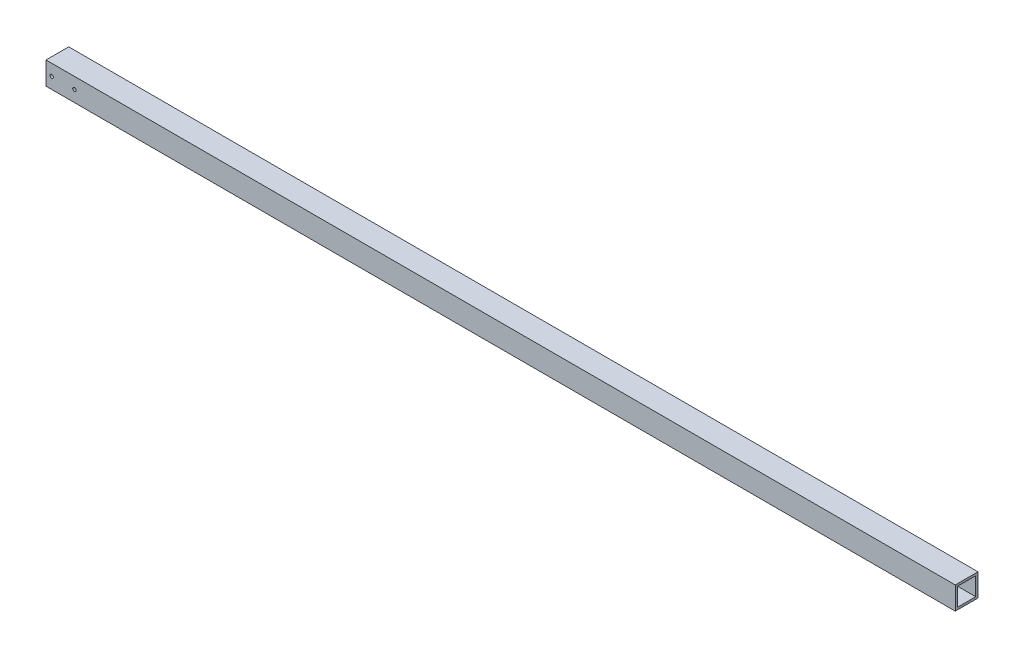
from build123d import *

# Parameters (mm, degrees)
SKETCH_1_W          = 20
SKETCH_1_H          = 20
SKETCH_1_W_2        = 16
SKETCH_1_H_2        = 16
EXTRUDE_1_DEPTH     = 800
SKETCH_2_R          = 1.5
CUT_EXTRUDE_2_DEPTH = 801.312438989
SKETCH_3_R          = 1.5
CUT_EXTRUDE_3_DEPTH = 801.312438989


with BuildPart() as part:
    # Sketch 1 → Extrude 1 (new body)
    with BuildSketch(Plane(origin=(0, 0, 0), x_dir=(0, 0, -1), z_dir=(1, 0, 0))):
        Rectangle(SKETCH_1_W, SKETCH_1_H)
        Rectangle(SKETCH_1_W_2, SKETCH_1_H_2, mode=Mode.SUBTRACT)
    extrude(amount=EXTRUDE_1_DEPTH)

    # Sketch 2 → Cut-Extrude 2 (cut, through all)
    with BuildSketch(Plane.XY.offset(10)):
        with Locations((5, 0)):
            Circle(SKETCH_2_R)
    extrude(amount=-CUT_EXTRUDE_2_DEPTH, mode=Mode.SUBTRACT)

    # Sketch 3 → Cut-Extrude 3 (cut, through all)
    with BuildSketch(Plane.XY.offset(10)):
        with Locations((25, 0)):
            Circle(SKETCH_3_R)
    extrude(amount=-CUT_EXTRUDE_3_DEPTH, mode=Mode.SUBTRACT)


solid = part.part
